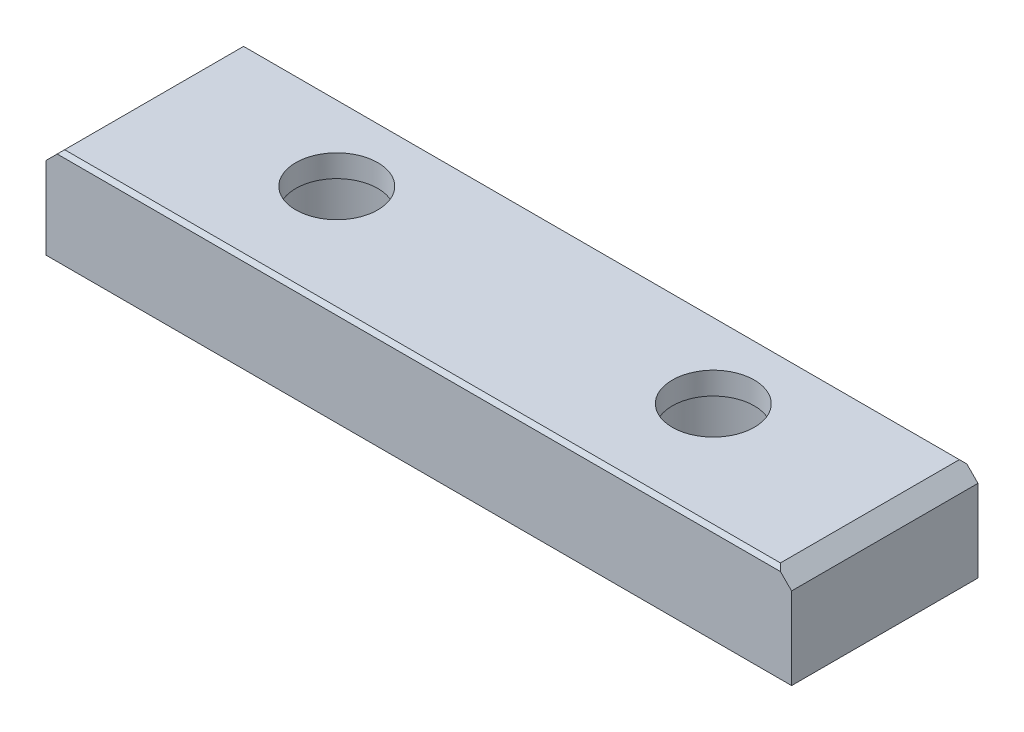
ISO-10303-21;
HEADER;
FILE_DESCRIPTION(('STEP AP214'),'2;1');
FILE_NAME('part.step','',(''),(''),'','','');
FILE_SCHEMA(('AUTOMOTIVE_DESIGN { 1 0 10303 214 1 1 1 1 }'));
ENDSEC;
DATA;
#1=APPLICATION_CONTEXT('core data for automotive mechanical design processes');
#2=APPLICATION_PROTOCOL_DEFINITION('international standard','automotive_design',2000,#1);
#3=PRODUCT_CONTEXT('',#1,'mechanical');
#4=PRODUCT('Part','Part','',(#3));
#5=PRODUCT_RELATED_PRODUCT_CATEGORY('part','',(#4));
#6=PRODUCT_DEFINITION_FORMATION('','',#4);
#7=PRODUCT_DEFINITION_CONTEXT('part definition',#1,'design');
#8=PRODUCT_DEFINITION('design','',#6,#7);
#9=PRODUCT_DEFINITION_SHAPE('','',#8);
#10=(LENGTH_UNIT() NAMED_UNIT(*) SI_UNIT(.MILLI.,.METRE.));
#11=(NAMED_UNIT(*) PLANE_ANGLE_UNIT() SI_UNIT($,.RADIAN.));
#12=(NAMED_UNIT(*) SI_UNIT($,.STERADIAN.) SOLID_ANGLE_UNIT());
#13=UNCERTAINTY_MEASURE_WITH_UNIT(LENGTH_MEASURE(1.E-05),#10,'distance_accuracy_value','');
#14=(GEOMETRIC_REPRESENTATION_CONTEXT(3) GLOBAL_UNCERTAINTY_ASSIGNED_CONTEXT((#13)) GLOBAL_UNIT_ASSIGNED_CONTEXT((#10,
#11,#12)) REPRESENTATION_CONTEXT('',''));
#15=CARTESIAN_POINT('',(0.,0.,0.));
#16=DIRECTION('',(0.,0.,1.));
#17=DIRECTION('',(1.,0.,0.));
#18=AXIS2_PLACEMENT_3D('',#15,#16,#17);
#19=CARTESIAN_POINT('',(0.,0.,-25.));
#20=DIRECTION('',(-1.,0.,0.));
#21=DIRECTION('',(0.,0.,1.));
#22=AXIS2_PLACEMENT_3D('',#19,#20,#21);
#23=PLANE('',#22);
#24=DIRECTION('',(0.,-1.,0.));
#25=VECTOR('',#24,1.);
#26=CARTESIAN_POINT('',(0.,0.,0.));
#27=LINE('',#26,#25);
#28=CARTESIAN_POINT('',(0.,11.,0.));
#29=VERTEX_POINT('',#28);
#30=CARTESIAN_POINT('',(0.,0.,0.));
#31=VERTEX_POINT('',#30);
#32=EDGE_CURVE('E423',#29,#31,#27,.T.);
#33=ORIENTED_EDGE('',*,*,#32,.F.);
#34=DIRECTION('',(0.,0.,1.));
#35=VECTOR('',#34,1.);
#36=CARTESIAN_POINT('',(0.,11.,-25.));
#37=LINE('',#36,#35);
#38=CARTESIAN_POINT('',(0.,11.,-25.));
#39=VERTEX_POINT('',#38);
#40=EDGE_CURVE('E464',#39,#29,#37,.T.);
#41=ORIENTED_EDGE('',*,*,#40,.F.);
#42=DIRECTION('',(0.,-1.,0.));
#43=VECTOR('',#42,1.);
#44=CARTESIAN_POINT('',(0.,0.,-25.));
#45=LINE('',#44,#43);
#46=CARTESIAN_POINT('',(0.,0.,-25.));
#47=VERTEX_POINT('',#46);
#48=EDGE_CURVE('E425',#39,#47,#45,.T.);
#49=ORIENTED_EDGE('',*,*,#48,.T.);
#50=DIRECTION('',(0.,0.,1.));
#51=VECTOR('',#50,1.);
#52=CARTESIAN_POINT('',(0.,0.,-25.));
#53=LINE('',#52,#51);
#54=EDGE_CURVE('E419',#47,#31,#53,.T.);
#55=ORIENTED_EDGE('',*,*,#54,.T.);
#56=EDGE_LOOP('',(#33,#41,#49,#55));
#57=FACE_BOUND('',#56,.T.);
#58=ADVANCED_FACE('F351',(#57),#23,.T.);
#59=CARTESIAN_POINT('',(0.,11.,-25.));
#60=DIRECTION('',(-0.707106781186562,0.707106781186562,0.));
#61=DIRECTION('',(-0.707106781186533,-0.707106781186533,0.));
#62=AXIS2_PLACEMENT_3D('',#59,#60,#61);
#63=PLANE('',#62);
#64=DIRECTION('',(0.,0.,1.));
#65=VECTOR('',#64,1.);
#66=CARTESIAN_POINT('',(1.99999999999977,12.9999999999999,-25.));
#67=LINE('',#66,#65);
#68=CARTESIAN_POINT('',(1.99999999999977,12.9999999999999,-24.5));
#69=VERTEX_POINT('',#68);
#70=CARTESIAN_POINT('',(1.99999999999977,12.9999999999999,-0.5));
#71=VERTEX_POINT('',#70);
#72=EDGE_CURVE('E467',#69,#71,#67,.T.);
#73=ORIENTED_EDGE('',*,*,#72,.F.);
#74=DIRECTION('',(0.577350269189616,0.577350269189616,0.577350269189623));
#75=VECTOR('',#74,1.);
#76=CARTESIAN_POINT('',(0.499999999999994,11.5,-26.));
#77=LINE('',#76,#75);
#78=CARTESIAN_POINT('',(1.49999999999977,12.5,-25.));
#79=VERTEX_POINT('',#78);
#80=EDGE_CURVE('E481',#69,#79,#77,.F.);
#81=ORIENTED_EDGE('',*,*,#80,.T.);
#82=DIRECTION('',(-0.707106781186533,-0.707106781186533,0.));
#83=VECTOR('',#82,1.);
#84=CARTESIAN_POINT('',(0.,11.,-25.));
#85=LINE('',#84,#83);
#86=EDGE_CURVE('E430',#79,#39,#85,.T.);
#87=ORIENTED_EDGE('',*,*,#86,.T.);
#88=ORIENTED_EDGE('',*,*,#40,.T.);
#89=DIRECTION('',(-0.707106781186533,-0.707106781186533,0.));
#90=VECTOR('',#89,1.);
#91=CARTESIAN_POINT('',(0.,11.,0.));
#92=LINE('',#91,#90);
#93=CARTESIAN_POINT('',(1.49999999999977,12.5,0.));
#94=VERTEX_POINT('',#93);
#95=EDGE_CURVE('E442',#94,#29,#92,.T.);
#96=ORIENTED_EDGE('',*,*,#95,.F.);
#97=DIRECTION('',(0.577350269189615,0.577350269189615,-0.577350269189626));
#98=VECTOR('',#97,1.);
#99=CARTESIAN_POINT('',(8.83333333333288,19.8333333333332,-7.33333333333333));
#100=LINE('',#99,#98);
#101=EDGE_CURVE('E479',#94,#71,#100,.T.);
#102=ORIENTED_EDGE('',*,*,#101,.T.);
#103=EDGE_LOOP('',(#73,#81,#87,#88,#96,#102));
#104=FACE_BOUND('',#103,.T.);
#105=ADVANCED_FACE('F495',(#104),#63,.T.);
#106=CARTESIAN_POINT('',(1.99999999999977,12.9999999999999,-25.));
#107=DIRECTION('',(0.,1.,0.));
#108=DIRECTION('',(0.,0.,1.));
#109=AXIS2_PLACEMENT_3D('',#106,#107,#108);
#110=PLANE('',#109);
#111=CARTESIAN_POINT('',(75.,12.9999999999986,-14.5));
#112=DIRECTION('',(0.,1.,0.));
#113=DIRECTION('',(0.,0.,1.));
#114=AXIS2_PLACEMENT_3D('',#111,#112,#113);
#115=CIRCLE('',#114,5.5);
#116=CARTESIAN_POINT('',(75.,12.9999999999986,-9.));
#117=VERTEX_POINT('',#116);
#118=EDGE_CURVE('E545',#117,#117,#115,.T.);
#119=ORIENTED_EDGE('',*,*,#118,.F.);
#120=EDGE_LOOP('',(#119));
#121=FACE_BOUND('',#120,.T.);
#122=CARTESIAN_POINT('',(24.4999999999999,12.9999999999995,-14.5));
#123=DIRECTION('',(0.,1.,0.));
#124=DIRECTION('',(0.,0.,1.));
#125=AXIS2_PLACEMENT_3D('',#122,#123,#124);
#126=CIRCLE('',#125,5.5);
#127=CARTESIAN_POINT('',(24.4999999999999,12.9999999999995,-9.));
#128=VERTEX_POINT('',#127);
#129=EDGE_CURVE('E444',#128,#128,#126,.T.);
#130=ORIENTED_EDGE('',*,*,#129,.F.);
#131=EDGE_LOOP('',(#130));
#132=FACE_BOUND('',#131,.T.);
#133=DIRECTION('',(0.,0.,1.));
#134=VECTOR('',#133,1.);
#135=CARTESIAN_POINT('',(98.,12.9999999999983,-25.));
#136=LINE('',#135,#134);
#137=CARTESIAN_POINT('',(98.,12.9999999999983,-24.5));
#138=VERTEX_POINT('',#137);
#139=CARTESIAN_POINT('',(98.,12.9999999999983,-0.5));
#140=VERTEX_POINT('',#139);
#141=EDGE_CURVE('E470',#138,#140,#136,.T.);
#142=ORIENTED_EDGE('',*,*,#141,.F.);
#143=DIRECTION('',(-1.,0.,0.));
#144=VECTOR('',#143,1.);
#145=CARTESIAN_POINT('',(1.99999999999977,12.9999999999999,-24.5));
#146=LINE('',#145,#144);
#147=EDGE_CURVE('E476',#138,#69,#146,.T.);
#148=ORIENTED_EDGE('',*,*,#147,.T.);
#149=ORIENTED_EDGE('',*,*,#72,.T.);
#150=DIRECTION('',(1.,0.,0.));
#151=VECTOR('',#150,1.);
#152=CARTESIAN_POINT('',(98.,12.9999999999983,-0.5));
#153=LINE('',#152,#151);
#154=EDGE_CURVE('E466',#71,#140,#153,.T.);
#155=ORIENTED_EDGE('',*,*,#154,.T.);
#156=EDGE_LOOP('',(#142,#148,#149,#155));
#157=FACE_BOUND('',#156,.T.);
#158=ADVANCED_FACE('F490',(#121,#132,#157),#110,.T.);
#159=CARTESIAN_POINT('',(98.,12.9999999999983,-25.));
#160=DIRECTION('',(0.707106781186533,0.707106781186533,0.));
#161=DIRECTION('',(-0.707106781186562,0.707106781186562,0.));
#162=AXIS2_PLACEMENT_3D('',#159,#160,#161);
#163=PLANE('',#162);
#164=DIRECTION('',(-0.707106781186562,0.707106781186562,0.));
#165=VECTOR('',#164,1.);
#166=CARTESIAN_POINT('',(98.,12.9999999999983,-25.));
#167=LINE('',#166,#165);
#168=CARTESIAN_POINT('',(100.,10.9999999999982,-25.));
#169=VERTEX_POINT('',#168);
#170=CARTESIAN_POINT('',(98.5,12.4999999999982,-25.));
#171=VERTEX_POINT('',#170);
#172=EDGE_CURVE('E461',#169,#171,#167,.T.);
#173=ORIENTED_EDGE('',*,*,#172,.T.);
#174=DIRECTION('',(0.577350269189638,-0.577350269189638,-0.577350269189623));
#175=VECTOR('',#174,1.);
#176=CARTESIAN_POINT('',(98.1666666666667,12.8333333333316,-24.6666666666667));
#177=LINE('',#176,#175);
#178=EDGE_CURVE('E358',#171,#138,#177,.F.);
#179=ORIENTED_EDGE('',*,*,#178,.T.);
#180=ORIENTED_EDGE('',*,*,#141,.T.);
#181=DIRECTION('',(0.577350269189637,-0.577350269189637,0.577350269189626));
#182=VECTOR('',#181,1.);
#183=CARTESIAN_POINT('',(89.8333333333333,21.1666666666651,-8.66666666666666));
#184=LINE('',#183,#182);
#185=CARTESIAN_POINT('',(98.5,12.4999999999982,0.));
#186=VERTEX_POINT('',#185);
#187=EDGE_CURVE('E365',#140,#186,#184,.T.);
#188=ORIENTED_EDGE('',*,*,#187,.T.);
#189=DIRECTION('',(-0.707106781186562,0.707106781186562,0.));
#190=VECTOR('',#189,1.);
#191=CARTESIAN_POINT('',(98.,12.9999999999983,0.));
#192=LINE('',#191,#190);
#193=CARTESIAN_POINT('',(100.,10.9999999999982,0.));
#194=VERTEX_POINT('',#193);
#195=EDGE_CURVE('E452',#194,#186,#192,.T.);
#196=ORIENTED_EDGE('',*,*,#195,.F.);
#197=DIRECTION('',(0.,0.,1.));
#198=VECTOR('',#197,1.);
#199=CARTESIAN_POINT('',(100.,10.9999999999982,-25.));
#200=LINE('',#199,#198);
#201=EDGE_CURVE('E472',#169,#194,#200,.T.);
#202=ORIENTED_EDGE('',*,*,#201,.F.);
#203=EDGE_LOOP('',(#173,#179,#180,#188,#196,#202));
#204=FACE_BOUND('',#203,.T.);
#205=ADVANCED_FACE('F486',(#204),#163,.T.);
#206=CARTESIAN_POINT('',(100.,-1.83186799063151E-12,-25.));
#207=DIRECTION('',(1.,0.,0.));
#208=DIRECTION('',(0.,0.,-1.));
#209=AXIS2_PLACEMENT_3D('',#206,#207,#208);
#210=PLANE('',#209);
#211=DIRECTION('',(0.,1.,0.));
#212=VECTOR('',#211,1.);
#213=CARTESIAN_POINT('',(100.,-1.83186799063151E-12,0.));
#214=LINE('',#213,#212);
#215=CARTESIAN_POINT('',(100.,-1.83186799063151E-12,0.));
#216=VERTEX_POINT('',#215);
#217=EDGE_CURVE('E438',#216,#194,#214,.T.);
#218=ORIENTED_EDGE('',*,*,#217,.F.);
#219=DIRECTION('',(0.,0.,1.));
#220=VECTOR('',#219,1.);
#221=CARTESIAN_POINT('',(100.,-1.83186799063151E-12,-25.));
#222=LINE('',#221,#220);
#223=CARTESIAN_POINT('',(100.,-1.83186799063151E-12,-25.));
#224=VERTEX_POINT('',#223);
#225=EDGE_CURVE('E429',#224,#216,#222,.T.);
#226=ORIENTED_EDGE('',*,*,#225,.F.);
#227=DIRECTION('',(0.,1.,0.));
#228=VECTOR('',#227,1.);
#229=CARTESIAN_POINT('',(100.,-1.83186799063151E-12,-25.));
#230=LINE('',#229,#228);
#231=EDGE_CURVE('E458',#224,#169,#230,.T.);
#232=ORIENTED_EDGE('',*,*,#231,.T.);
#233=ORIENTED_EDGE('',*,*,#201,.T.);
#234=EDGE_LOOP('',(#218,#226,#232,#233));
#235=FACE_BOUND('',#234,.T.);
#236=ADVANCED_FACE('F499',(#235),#210,.T.);
#237=CARTESIAN_POINT('',(0.,0.,-25.));
#238=DIRECTION('',(0.,-1.,0.));
#239=DIRECTION('',(0.,0.,-1.));
#240=AXIS2_PLACEMENT_3D('',#237,#238,#239);
#241=PLANE('',#240);
#242=CARTESIAN_POINT('',(75.,-1.37563571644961E-12,-14.5));
#243=DIRECTION('',(0.,-1.,0.));
#244=DIRECTION('',(0.,0.,-1.));
#245=AXIS2_PLACEMENT_3D('',#242,#243,#244);
#246=CIRCLE('',#245,8.99999999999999);
#247=CARTESIAN_POINT('',(75.,-1.37563571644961E-12,-23.5));
#248=VERTEX_POINT('',#247);
#249=EDGE_CURVE('E534',#248,#248,#246,.T.);
#250=ORIENTED_EDGE('',*,*,#249,.F.);
#251=EDGE_LOOP('',(#250));
#252=FACE_BOUND('',#251,.T.);
#253=CARTESIAN_POINT('',(24.5000000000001,-4.57966997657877E-13,-14.5));
#254=DIRECTION('',(0.,-1.,0.));
#255=DIRECTION('',(0.,0.,-1.));
#256=AXIS2_PLACEMENT_3D('',#253,#254,#255);
#257=CIRCLE('',#256,9.);
#258=CARTESIAN_POINT('',(24.5000000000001,-4.57966997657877E-13,-23.5));
#259=VERTEX_POINT('',#258);
#260=EDGE_CURVE('E447',#259,#259,#257,.T.);
#261=ORIENTED_EDGE('',*,*,#260,.F.);
#262=EDGE_LOOP('',(#261));
#263=FACE_BOUND('',#262,.T.);
#264=DIRECTION('',(1.,0.,0.));
#265=VECTOR('',#264,1.);
#266=CARTESIAN_POINT('',(0.,0.,0.));
#267=LINE('',#266,#265);
#268=EDGE_CURVE('E433',#31,#216,#267,.T.);
#269=ORIENTED_EDGE('',*,*,#268,.F.);
#270=ORIENTED_EDGE('',*,*,#54,.F.);
#271=DIRECTION('',(1.,0.,0.));
#272=VECTOR('',#271,1.);
#273=CARTESIAN_POINT('',(0.,0.,-25.));
#274=LINE('',#273,#272);
#275=EDGE_CURVE('E456',#47,#224,#274,.T.);
#276=ORIENTED_EDGE('',*,*,#275,.T.);
#277=ORIENTED_EDGE('',*,*,#225,.T.);
#278=EDGE_LOOP('',(#269,#270,#276,#277));
#279=FACE_BOUND('',#278,.T.);
#280=ADVANCED_FACE('F434',(#252,#263,#279),#241,.T.);
#281=CARTESIAN_POINT('',(-2.28983498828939E-13,13.,-25.));
#282=DIRECTION('',(0.,0.,-1.));
#283=DIRECTION('',(-1.,0.,0.));
#284=AXIS2_PLACEMENT_3D('',#281,#282,#283);
#285=PLANE('',#284);
#286=ORIENTED_EDGE('',*,*,#86,.F.);
#287=DIRECTION('',(1.,0.,0.));
#288=VECTOR('',#287,1.);
#289=CARTESIAN_POINT('',(-2.28983498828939E-13,12.5,-25.));
#290=LINE('',#289,#288);
#291=EDGE_CURVE('E373',#79,#171,#290,.T.);
#292=ORIENTED_EDGE('',*,*,#291,.T.);
#293=ORIENTED_EDGE('',*,*,#172,.F.);
#294=ORIENTED_EDGE('',*,*,#231,.F.);
#295=ORIENTED_EDGE('',*,*,#275,.F.);
#296=ORIENTED_EDGE('',*,*,#48,.F.);
#297=EDGE_LOOP('',(#286,#292,#293,#294,#295,#296));
#298=FACE_BOUND('',#297,.T.);
#299=ADVANCED_FACE('F496',(#298),#285,.T.);
#300=CARTESIAN_POINT('',(-2.28983498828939E-13,13.,0.));
#301=DIRECTION('',(0.,0.,-1.));
#302=DIRECTION('',(-1.,0.,0.));
#303=AXIS2_PLACEMENT_3D('',#300,#301,#302);
#304=PLANE('',#303);
#305=ORIENTED_EDGE('',*,*,#195,.T.);
#306=DIRECTION('',(-1.,0.,0.));
#307=VECTOR('',#306,1.);
#308=CARTESIAN_POINT('',(1.99999999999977,12.4999999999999,0.));
#309=LINE('',#308,#307);
#310=EDGE_CURVE('E11',#186,#94,#309,.T.);
#311=ORIENTED_EDGE('',*,*,#310,.T.);
#312=ORIENTED_EDGE('',*,*,#95,.T.);
#313=ORIENTED_EDGE('',*,*,#32,.T.);
#314=ORIENTED_EDGE('',*,*,#268,.T.);
#315=ORIENTED_EDGE('',*,*,#217,.T.);
#316=EDGE_LOOP('',(#305,#311,#312,#313,#314,#315));
#317=FACE_BOUND('',#316,.T.);
#318=ADVANCED_FACE('F440',(#317),#304,.F.);
#319=CARTESIAN_POINT('',(24.5000000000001,-4.57966997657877E-13,-14.5));
#320=DIRECTION('',(0.,-1.,0.));
#321=DIRECTION('',(0.,0.,-1.));
#322=AXIS2_PLACEMENT_3D('',#319,#320,#321);
#323=CYLINDRICAL_SURFACE('',#322,5.5);
#324=CARTESIAN_POINT('',(24.4999999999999,9.99999999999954,-14.5));
#325=DIRECTION('',(0.,-1.,0.));
#326=DIRECTION('',(0.,0.,-1.));
#327=AXIS2_PLACEMENT_3D('',#324,#325,#326);
#328=CIRCLE('',#327,5.50000000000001);
#329=CARTESIAN_POINT('',(24.4999999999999,9.99999999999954,-20.));
#330=VERTEX_POINT('',#329);
#331=EDGE_CURVE('E540',#330,#330,#328,.T.);
#332=ORIENTED_EDGE('',*,*,#331,.T.);
#333=EDGE_LOOP('',(#332));
#334=FACE_BOUND('',#333,.T.);
#335=ORIENTED_EDGE('',*,*,#129,.T.);
#336=EDGE_LOOP('',(#335));
#337=FACE_BOUND('',#336,.T.);
#338=ADVANCED_FACE('F574',(#334,#337),#323,.F.);
#339=CARTESIAN_POINT('',(24.5000000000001,-4.57966997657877E-13,-14.5));
#340=DIRECTION('',(0.,-1.,0.));
#341=DIRECTION('',(0.,0.,-1.));
#342=AXIS2_PLACEMENT_3D('',#339,#340,#341);
#343=CYLINDRICAL_SURFACE('',#342,9.);
#344=CARTESIAN_POINT('',(24.4999999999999,9.99999999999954,-14.5));
#345=DIRECTION('',(0.,-1.,0.));
#346=DIRECTION('',(0.,0.,-1.));
#347=AXIS2_PLACEMENT_3D('',#344,#345,#346);
#348=CIRCLE('',#347,9.);
#349=CARTESIAN_POINT('',(24.4999999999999,9.99999999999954,-23.5));
#350=VERTEX_POINT('',#349);
#351=EDGE_CURVE('E538',#350,#350,#348,.T.);
#352=ORIENTED_EDGE('',*,*,#351,.F.);
#353=EDGE_LOOP('',(#352));
#354=FACE_BOUND('',#353,.T.);
#355=ORIENTED_EDGE('',*,*,#260,.T.);
#356=EDGE_LOOP('',(#355));
#357=FACE_BOUND('',#356,.T.);
#358=ADVANCED_FACE('F577',(#354,#357),#343,.F.);
#359=CARTESIAN_POINT('',(29.9999999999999,9.99999999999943,-14.5));
#360=DIRECTION('',(0.,1.,0.));
#361=DIRECTION('',(0.,0.,1.));
#362=AXIS2_PLACEMENT_3D('',#359,#360,#361);
#363=PLANE('',#362);
#364=ORIENTED_EDGE('',*,*,#331,.F.);
#365=EDGE_LOOP('',(#364));
#366=FACE_BOUND('',#365,.T.);
#367=ORIENTED_EDGE('',*,*,#351,.T.);
#368=EDGE_LOOP('',(#367));
#369=FACE_BOUND('',#368,.T.);
#370=ADVANCED_FACE('F571',(#366,#369),#363,.F.);
#371=CARTESIAN_POINT('',(75.,-1.37390099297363E-12,-14.5));
#372=DIRECTION('',(0.,-1.,0.));
#373=DIRECTION('',(0.,0.,-1.));
#374=AXIS2_PLACEMENT_3D('',#371,#372,#373);
#375=CYLINDRICAL_SURFACE('',#374,5.5);
#376=CARTESIAN_POINT('',(75.,9.99999999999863,-14.5));
#377=DIRECTION('',(0.,-1.,0.));
#378=DIRECTION('',(0.,0.,-1.));
#379=AXIS2_PLACEMENT_3D('',#376,#377,#378);
#380=CIRCLE('',#379,5.50000000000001);
#381=CARTESIAN_POINT('',(75.,9.99999999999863,-20.));
#382=VERTEX_POINT('',#381);
#383=EDGE_CURVE('E552',#382,#382,#380,.T.);
#384=ORIENTED_EDGE('',*,*,#383,.T.);
#385=EDGE_LOOP('',(#384));
#386=FACE_BOUND('',#385,.T.);
#387=ORIENTED_EDGE('',*,*,#118,.T.);
#388=EDGE_LOOP('',(#387));
#389=FACE_BOUND('',#388,.T.);
#390=ADVANCED_FACE('F556',(#386,#389),#375,.F.);
#391=CARTESIAN_POINT('',(75.,-1.37390099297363E-12,-14.5));
#392=DIRECTION('',(0.,-1.,0.));
#393=DIRECTION('',(0.,0.,-1.));
#394=AXIS2_PLACEMENT_3D('',#391,#392,#393);
#395=CYLINDRICAL_SURFACE('',#394,8.99999999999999);
#396=CARTESIAN_POINT('',(75.,9.99999999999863,-14.5));
#397=DIRECTION('',(0.,-1.,0.));
#398=DIRECTION('',(0.,0.,-1.));
#399=AXIS2_PLACEMENT_3D('',#396,#397,#398);
#400=CIRCLE('',#399,8.99999999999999);
#401=CARTESIAN_POINT('',(75.,9.99999999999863,-23.5));
#402=VERTEX_POINT('',#401);
#403=EDGE_CURVE('E549',#402,#402,#400,.T.);
#404=ORIENTED_EDGE('',*,*,#403,.F.);
#405=EDGE_LOOP('',(#404));
#406=FACE_BOUND('',#405,.T.);
#407=ORIENTED_EDGE('',*,*,#249,.T.);
#408=EDGE_LOOP('',(#407));
#409=FACE_BOUND('',#408,.T.);
#410=ADVANCED_FACE('F561',(#406,#409),#395,.F.);
#411=CARTESIAN_POINT('',(80.5,9.99999999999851,-14.5));
#412=DIRECTION('',(0.,1.,0.));
#413=DIRECTION('',(0.,0.,1.));
#414=AXIS2_PLACEMENT_3D('',#411,#412,#413);
#415=PLANE('',#414);
#416=ORIENTED_EDGE('',*,*,#383,.F.);
#417=EDGE_LOOP('',(#416));
#418=FACE_BOUND('',#417,.T.);
#419=ORIENTED_EDGE('',*,*,#403,.T.);
#420=EDGE_LOOP('',(#419));
#421=FACE_BOUND('',#420,.T.);
#422=ADVANCED_FACE('F508',(#418,#421),#415,.F.);
#423=CARTESIAN_POINT('',(1.99999999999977,12.9999999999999,-24.5));
#424=DIRECTION('',(0.,-0.707106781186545,0.70710678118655));
#425=DIRECTION('',(0.,-0.70710678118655,-0.707106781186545));
#426=AXIS2_PLACEMENT_3D('',#423,#424,#425);
#427=PLANE('',#426);
#428=ORIENTED_EDGE('',*,*,#178,.F.);
#429=ORIENTED_EDGE('',*,*,#291,.F.);
#430=ORIENTED_EDGE('',*,*,#80,.F.);
#431=ORIENTED_EDGE('',*,*,#147,.F.);
#432=EDGE_LOOP('',(#428,#429,#430,#431));
#433=FACE_BOUND('',#432,.T.);
#434=ADVANCED_FACE('F493',(#433),#427,.F.);
#435=CARTESIAN_POINT('',(-2.28983498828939E-13,12.5,0.));
#436=DIRECTION('',(0.,0.707106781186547,0.707106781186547));
#437=DIRECTION('',(0.,-0.707106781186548,0.707106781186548));
#438=AXIS2_PLACEMENT_3D('',#435,#436,#437);
#439=PLANE('',#438);
#440=ORIENTED_EDGE('',*,*,#187,.F.);
#441=ORIENTED_EDGE('',*,*,#154,.F.);
#442=ORIENTED_EDGE('',*,*,#101,.F.);
#443=ORIENTED_EDGE('',*,*,#310,.F.);
#444=EDGE_LOOP('',(#440,#441,#442,#443));
#445=FACE_BOUND('',#444,.T.);
#446=ADVANCED_FACE('F502',(#445),#439,.T.);
#447=CLOSED_SHELL('',(#58,#105,#158,#205,#236,#280,#299,#318,#338,#358,#370,#390,#410,#422,#434,#446));
#448=MANIFOLD_SOLID_BREP('B2',#447);
#449=ADVANCED_BREP_SHAPE_REPRESENTATION('',(#18,#448),#14);
#450=SHAPE_DEFINITION_REPRESENTATION(#9,#449);
ENDSEC;
END-ISO-10303-21;
